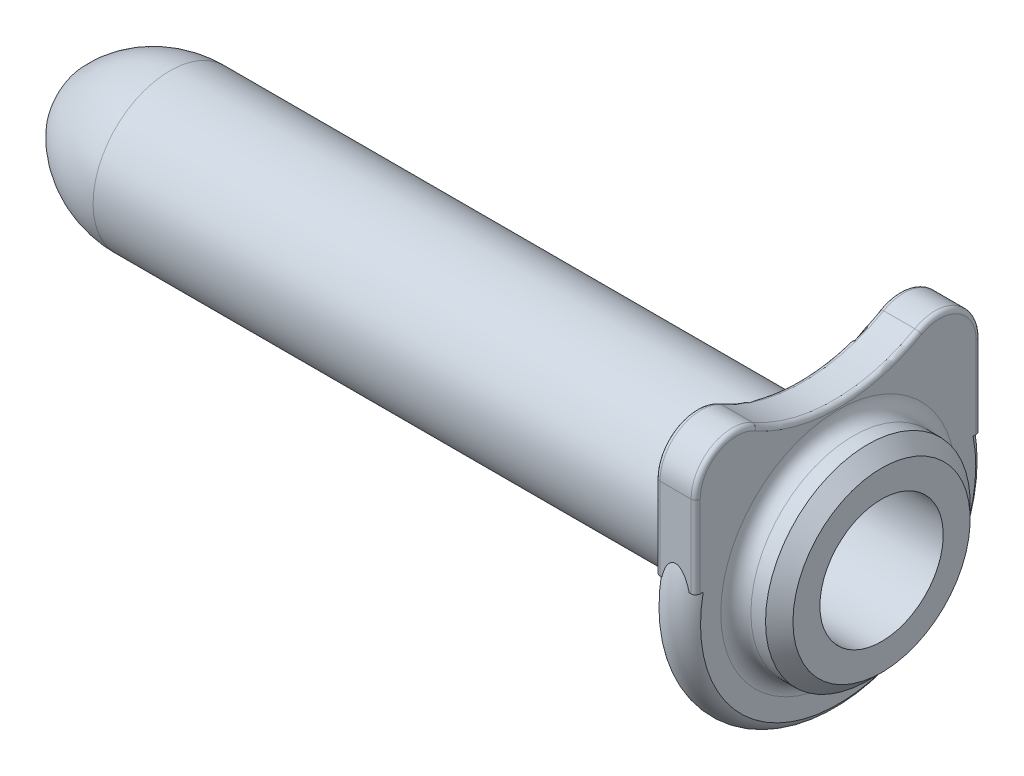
from build123d import *

# Parameters (mm, degrees)
CUT_EXTRUDE1_DEPTH  = 2.54
BOSS_EXTRUDE1_DEPTH = 2.2352
FILLET4_R           = 0.254


with BuildPart() as part:
    # Sketch1 → Revolve1 (revolve)
    with BuildSketch(Plane.XY, mode=Mode.PRIVATE) as revolve1_sk:
        with BuildLine():
            Line((0, 2.131686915), (0.6269736, 1.575374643))
            ThreePointArc((0.6269736, 1.575374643), (2.489621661, 2.944279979), (4.7498, 3.429))
            Line((4.7498, 3.429), (44.323, 3.429))
            Line((44.323, 3.429), (44.323, 4.9276))
            Line((44.323, 4.9276), (43.561, 5.6896))
            Line((43.561, 5.6896), (42.7482, 5.6896))
            ThreePointArc((42.7482, 5.6896), (42.155503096, 5.935103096), (41.91, 6.5278))
            Line((41.91, 6.5278), (41.91, 7.651716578))
            ThreePointArc((41.91, 7.651716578), (40.7924, 8.3185), (39.6748, 7.651716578))
            Line((39.6748, 7.651716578), (39.6748, 4.2672))
            Line((39.6748, 4.2672), (4.7498, 4.2672))
            ThreePointArc((4.7498, 4.2672), (2.145907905, 3.708766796), (0, 2.131686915))
        make_face()
    revolve(revolve1_sk.sketch.rotate(Axis((0, 0, 0), (1, 0, 0)), 90), axis=Axis((0, 0, 0), (1, 0, 0)))

    # Sketch2 → Cut-Extrude1 (cut, symmetric)
    with BuildSketch(Plane(origin=(41.91, 0, 0), x_dir=(0, 0, -1), z_dir=(1, 0, 0))):
        with BuildLine():
            ThreePointArc((-4.51104, 8.048179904), (0, 6.858), (4.51104, 8.048179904))
            add(Edge.make_bspline(
                [(-4.51104, 8.048179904), (-2.263405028, 13.715409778), (4.51104, 8.048179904)],
                knots=[0, 0, 0, 1, 1, 1], degree=2))
        make_face()
    extrude(amount=CUT_EXTRUDE1_DEPTH, both=True, mode=Mode.SUBTRACT)

    # Sketch2_3 → Boss-Extrude1 (add)
    with BuildSketch(Plane(origin=(41.91, 0, 0), x_dir=(0, 0, -1), z_dir=(1, 0, 0))):
        with BuildLine():
            ThreePointArc((-4.51104, 8.048179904), (-6.789394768, 8.035054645), (-7.9248, 6.05972488))
            Line((-7.9248, 6.05972488), (-7.9248, 1.497868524))
            Line((-7.9248, 1.497868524), (-7.503676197, 1.497868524))
            ThreePointArc((-7.503676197, 1.497868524), (-5.77912002, 5.015031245), (-2.539965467, 7.21784885))
            ThreePointArc((-2.539965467, 7.21784885), (-3.549863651, 7.575185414), (-4.51104, 8.048179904))
        make_face()
        with BuildLine():
            ThreePointArc((7.9248, 6.05972488), (6.789394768, 8.035054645), (4.51104, 8.048179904))
            ThreePointArc((4.51104, 8.048179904), (3.549863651, 7.575185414), (2.539965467, 7.21784885))
            ThreePointArc((2.539965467, 7.21784885), (5.77912002, 5.015031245), (7.503676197, 1.497868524))
            Line((7.503676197, 1.497868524), (7.9248, 1.497868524))
            Line((7.9248, 1.497868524), (7.9248, 6.05972488))
        make_face()
    extrude(amount=-BOSS_EXTRUDE1_DEPTH)

    # Fillet4
    fillet4_edges = [part.edges().sort_by_distance(p)[0] for p in [
        (41.91, 6.858, 0),
        (39.6748, 6.858, 0),
        (41.91, 8.035054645, 6.789394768),
        (41.91, 3.778796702, 7.9248),
        (39.6748, 3.778796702, 7.9248),
        (39.6748, 8.035054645, 6.789394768),
        (39.6748, 3.778796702, -7.9248),
        (41.91, 3.778796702, -7.9248),
        (39.6748, 8.035054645, -6.789394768),
        (41.91, 8.035054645, -6.789394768),
    ]]
    fillet(fillet4_edges, radius=FILLET4_R)


solid = part.part
